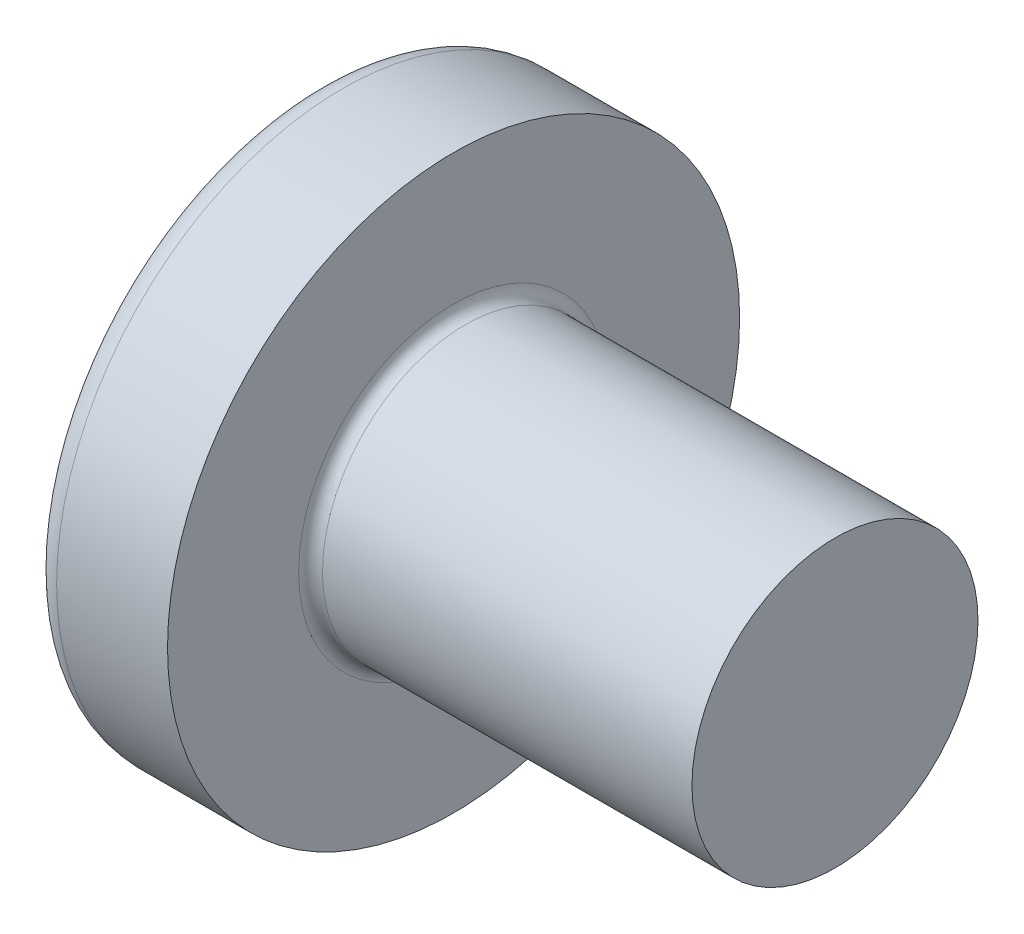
ISO-10303-21;
HEADER;
FILE_DESCRIPTION(('STEP AP214'),'2;1');
FILE_NAME('part.step','',(''),(''),'','','');
FILE_SCHEMA(('AUTOMOTIVE_DESIGN { 1 0 10303 214 1 1 1 1 }'));
ENDSEC;
DATA;
#1=APPLICATION_CONTEXT('core data for automotive mechanical design processes');
#2=APPLICATION_PROTOCOL_DEFINITION('international standard','automotive_design',2000,#1);
#3=PRODUCT_CONTEXT('',#1,'mechanical');
#4=PRODUCT('Part','Part','',(#3));
#5=PRODUCT_RELATED_PRODUCT_CATEGORY('part','',(#4));
#6=PRODUCT_DEFINITION_FORMATION('','',#4);
#7=PRODUCT_DEFINITION_CONTEXT('part definition',#1,'design');
#8=PRODUCT_DEFINITION('design','',#6,#7);
#9=PRODUCT_DEFINITION_SHAPE('','',#8);
#10=(LENGTH_UNIT() NAMED_UNIT(*) SI_UNIT(.MILLI.,.METRE.));
#11=(NAMED_UNIT(*) PLANE_ANGLE_UNIT() SI_UNIT($,.RADIAN.));
#12=(NAMED_UNIT(*) SI_UNIT($,.STERADIAN.) SOLID_ANGLE_UNIT());
#13=UNCERTAINTY_MEASURE_WITH_UNIT(LENGTH_MEASURE(1.E-05),#10,'distance_accuracy_value','');
#14=(GEOMETRIC_REPRESENTATION_CONTEXT(3) GLOBAL_UNCERTAINTY_ASSIGNED_CONTEXT((#13)) GLOBAL_UNIT_ASSIGNED_CONTEXT((#10,
#11,#12)) REPRESENTATION_CONTEXT('',''));
#15=CARTESIAN_POINT('',(0.,0.,0.));
#16=DIRECTION('',(0.,0.,1.));
#17=DIRECTION('',(1.,0.,0.));
#18=AXIS2_PLACEMENT_3D('',#15,#16,#17);
#19=CARTESIAN_POINT('',(10.,0.,0.));
#20=DIRECTION('',(-1.,0.,0.));
#21=DIRECTION('',(0.,1.,0.));
#22=AXIS2_PLACEMENT_3D('',#19,#20,#21);
#23=SPHERICAL_SURFACE('',#22,10.);
#24=CARTESIAN_POINT('',(1.83373872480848,0.,0.));
#25=DIRECTION('',(-1.,0.,0.));
#26=DIRECTION('',(0.,0.,1.));
#27=AXIS2_PLACEMENT_3D('',#24,#25,#26);
#28=CIRCLE('',#27,5.77167019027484);
#29=CARTESIAN_POINT('',(1.83373872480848,0.,5.77167019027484));
#30=VERTEX_POINT('',#29);
#31=EDGE_CURVE('E213',#30,#30,#28,.T.);
#32=ORIENTED_EDGE('',*,*,#31,.T.);
#33=EDGE_LOOP('',(#32));
#34=FACE_BOUND('',#33,.T.);
#35=CARTESIAN_POINT('',(0.11533271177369,0.,0.));
#36=DIRECTION('',(1.,0.,0.));
#37=DIRECTION('',(0.,0.,-1.));
#38=AXIS2_PLACEMENT_3D('',#35,#36,#37);
#39=CIRCLE('',#38,1.51438192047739);
#40=CARTESIAN_POINT('',(0.115332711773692,-0.709999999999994,-1.33762947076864));
#41=VERTEX_POINT('',#40);
#42=CARTESIAN_POINT('',(0.115332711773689,-1.33762947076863,-0.71));
#43=VERTEX_POINT('',#42);
#44=EDGE_CURVE('E339',#41,#43,#39,.F.);
#45=ORIENTED_EDGE('',*,*,#44,.F.);
#46=CARTESIAN_POINT('',(10.,-0.710000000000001,0.));
#47=DIRECTION('',(0.,1.,0.));
#48=DIRECTION('',(0.,0.,1.));
#49=AXIS2_PLACEMENT_3D('',#46,#47,#48);
#50=CIRCLE('',#49,9.97476315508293);
#51=CARTESIAN_POINT('',(0.5166959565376,-0.709999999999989,-3.09238490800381));
#52=VERTEX_POINT('',#51);
#53=EDGE_CURVE('E273',#52,#41,#50,.T.);
#54=ORIENTED_EDGE('',*,*,#53,.F.);
#55=CARTESIAN_POINT('',(9.34678967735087,0.,1.31013726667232));
#56=DIRECTION('',(0.446197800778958,0.,-0.894934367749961));
#57=DIRECTION('',(-0.89493436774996,0.,-0.446197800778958));
#58=AXIS2_PLACEMENT_3D('',#55,#56,#57);
#59=CIRCLE('',#58,9.89226246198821);
#60=CARTESIAN_POINT('',(0.5166959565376,0.710000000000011,-3.09238490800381));
#61=VERTEX_POINT('',#60);
#62=EDGE_CURVE('E247',#52,#61,#59,.T.);
#63=ORIENTED_EDGE('',*,*,#62,.T.);
#64=CARTESIAN_POINT('',(10.,0.71,0.));
#65=DIRECTION('',(0.,-1.,0.));
#66=DIRECTION('',(0.,0.,-1.));
#67=AXIS2_PLACEMENT_3D('',#64,#65,#66);
#68=CIRCLE('',#67,9.97476315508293);
#69=CARTESIAN_POINT('',(0.115332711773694,0.710000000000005,-1.33762947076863));
#70=VERTEX_POINT('',#69);
#71=EDGE_CURVE('E301',#70,#61,#68,.T.);
#72=ORIENTED_EDGE('',*,*,#71,.F.);
#73=CARTESIAN_POINT('',(0.115332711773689,1.33762947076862,-0.71));
#74=VERTEX_POINT('',#73);
#75=EDGE_CURVE('E354',#74,#70,#39,.F.);
#76=ORIENTED_EDGE('',*,*,#75,.F.);
#77=CARTESIAN_POINT('',(10.,0.,-0.71));
#78=DIRECTION('',(0.,0.,1.));
#79=DIRECTION('',(1.,0.,0.));
#80=AXIS2_PLACEMENT_3D('',#77,#78,#79);
#81=CIRCLE('',#80,9.97476315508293);
#82=CARTESIAN_POINT('',(0.516695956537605,3.09238490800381,-0.71));
#83=VERTEX_POINT('',#82);
#84=EDGE_CURVE('E241',#83,#74,#81,.T.);
#85=ORIENTED_EDGE('',*,*,#84,.F.);
#86=CARTESIAN_POINT('',(9.34678967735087,-1.31013726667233,0.));
#87=DIRECTION('',(0.446197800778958,0.89493436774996,0.));
#88=DIRECTION('',(-0.89493436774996,0.446197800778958,0.));
#89=AXIS2_PLACEMENT_3D('',#86,#87,#88);
#90=CIRCLE('',#89,9.89226246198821);
#91=CARTESIAN_POINT('',(0.516695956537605,3.09238490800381,0.71));
#92=VERTEX_POINT('',#91);
#93=EDGE_CURVE('E244',#83,#92,#90,.T.);
#94=ORIENTED_EDGE('',*,*,#93,.T.);
#95=CARTESIAN_POINT('',(10.,0.,0.71));
#96=DIRECTION('',(0.,0.,-1.));
#97=DIRECTION('',(-1.,0.,0.));
#98=AXIS2_PLACEMENT_3D('',#95,#96,#97);
#99=CIRCLE('',#98,9.97476315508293);
#100=CARTESIAN_POINT('',(0.115332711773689,1.33762947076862,0.709999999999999));
#101=VERTEX_POINT('',#100);
#102=EDGE_CURVE('E237',#101,#92,#99,.T.);
#103=ORIENTED_EDGE('',*,*,#102,.F.);
#104=CARTESIAN_POINT('',(0.115332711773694,0.709999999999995,1.33762947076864));
#105=VERTEX_POINT('',#104);
#106=EDGE_CURVE('E353',#105,#101,#39,.F.);
#107=ORIENTED_EDGE('',*,*,#106,.F.);
#108=CARTESIAN_POINT('',(0.516695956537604,0.709999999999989,3.09238490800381));
#109=VERTEX_POINT('',#108);
#110=EDGE_CURVE('E257',#109,#105,#68,.T.);
#111=ORIENTED_EDGE('',*,*,#110,.F.);
#112=CARTESIAN_POINT('',(9.34678967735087,0.,-1.31013726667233));
#113=DIRECTION('',(0.446197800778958,0.,0.89493436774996));
#114=DIRECTION('',(0.89493436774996,0.,-0.446197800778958));
#115=AXIS2_PLACEMENT_3D('',#112,#113,#114);
#116=CIRCLE('',#115,9.89226246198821);
#117=CARTESIAN_POINT('',(0.516695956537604,-0.710000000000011,3.09238490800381));
#118=VERTEX_POINT('',#117);
#119=EDGE_CURVE('E48',#109,#118,#116,.T.);
#120=ORIENTED_EDGE('',*,*,#119,.T.);
#121=CARTESIAN_POINT('',(0.115332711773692,-0.710000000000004,1.33762947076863));
#122=VERTEX_POINT('',#121);
#123=EDGE_CURVE('E254',#122,#118,#50,.T.);
#124=ORIENTED_EDGE('',*,*,#123,.F.);
#125=CARTESIAN_POINT('',(0.115332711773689,-1.33762947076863,0.709999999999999));
#126=VERTEX_POINT('',#125);
#127=EDGE_CURVE('E385',#126,#122,#39,.F.);
#128=ORIENTED_EDGE('',*,*,#127,.F.);
#129=CARTESIAN_POINT('',(0.5166959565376,-3.09238490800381,0.71));
#130=VERTEX_POINT('',#129);
#131=EDGE_CURVE('E238',#130,#126,#99,.T.);
#132=ORIENTED_EDGE('',*,*,#131,.F.);
#133=CARTESIAN_POINT('',(9.34678967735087,1.31013726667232,0.));
#134=DIRECTION('',(0.446197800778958,-0.894934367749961,0.));
#135=DIRECTION('',(0.89493436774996,0.446197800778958,0.));
#136=AXIS2_PLACEMENT_3D('',#133,#134,#135);
#137=CIRCLE('',#136,9.89226246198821);
#138=CARTESIAN_POINT('',(0.5166959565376,-3.09238490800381,-0.710000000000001));
#139=VERTEX_POINT('',#138);
#140=EDGE_CURVE('E234',#130,#139,#137,.T.);
#141=ORIENTED_EDGE('',*,*,#140,.T.);
#142=EDGE_CURVE('E63',#43,#139,#81,.T.);
#143=ORIENTED_EDGE('',*,*,#142,.F.);
#144=EDGE_LOOP('',(#45,#54,#63,#72,#76,#85,#94,#103,#107,#111,#120,#124,#128,#132,#141,#143));
#145=FACE_BOUND('',#144,.T.);
#146=ADVANCED_FACE('F35',(#34,#145),#23,.T.);
#147=CARTESIAN_POINT('',(3.46,1.6249076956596,-0.71));
#148=DIRECTION('',(0.,0.,1.));
#149=DIRECTION('',(1.,0.,0.));
#150=AXIS2_PLACEMENT_3D('',#147,#148,#149);
#151=PLANE('',#150);
#152=ORIENTED_EDGE('',*,*,#84,.T.);
#153=CARTESIAN_POINT('',(-2.28089704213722,1.52473965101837,-0.71));
#154=CARTESIAN_POINT('',(-1.81861622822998,1.48907386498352,-0.71));
#155=CARTESIAN_POINT('',(-1.35635131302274,1.45320000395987,-0.71));
#156=CARTESIAN_POINT('',(-0.431857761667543,1.3808964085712,-0.71));
#157=CARTESIAN_POINT('',(0.0303708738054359,1.34446666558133,-0.71));
#158=CARTESIAN_POINT('',(0.954772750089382,1.27091270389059,-0.71));
#159=CARTESIAN_POINT('',(1.41694599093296,1.23378848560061,-0.71));
#160=CARTESIAN_POINT('',(2.1101468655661,1.17741958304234,-0.71));
#161=CARTESIAN_POINT('',(2.34120225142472,1.15851633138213,-0.71));
#162=CARTESIAN_POINT('',(2.80329254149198,1.12044387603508,-0.71));
#163=CARTESIAN_POINT('',(3.03432744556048,1.10127467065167,-0.71));
#164=CARTESIAN_POINT('',(3.81376951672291,1.03608826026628,-0.71));
#165=CARTESIAN_POINT('',(4.3621185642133,0.989367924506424,-0.71));
#166=CARTESIAN_POINT('',(5.18446393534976,0.917336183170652,-0.71));
#167=CARTESIAN_POINT('',(5.45854573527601,0.893000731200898,-0.71));
#168=CARTESIAN_POINT('',(6.00663594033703,0.843493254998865,-0.71));
#169=CARTESIAN_POINT('',(6.28064434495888,0.818321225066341,-0.71));
#170=CARTESIAN_POINT('',(6.82859287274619,0.766879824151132,-0.71));
#171=CARTESIAN_POINT('',(7.10253298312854,0.74061031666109,-0.71));
#172=CARTESIAN_POINT('',(7.65026285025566,0.686585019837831,-0.71));
#173=CARTESIAN_POINT('',(7.92405260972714,0.658829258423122,-0.71));
#174=CARTESIAN_POINT('',(8.33458184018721,0.615573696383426,-0.71));
#175=CARTESIAN_POINT('',(8.4714065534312,0.600884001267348,-0.71));
#176=CARTESIAN_POINT('',(8.74498055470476,0.570826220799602,-0.71));
#177=CARTESIAN_POINT('',(8.88172984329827,0.555458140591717,-0.71));
#178=CARTESIAN_POINT('',(9.15513948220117,0.523868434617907,-0.71));
#179=CARTESIAN_POINT('',(9.29179982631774,0.507646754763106,-0.71));
#180=CARTESIAN_POINT('',(9.56498051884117,0.474039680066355,-0.71));
#181=CARTESIAN_POINT('',(9.70150086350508,0.45665425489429,-0.71));
#182=CARTESIAN_POINT('',(9.83792645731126,0.438531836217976,-0.71));
#183=B_SPLINE_CURVE_WITH_KNOTS('',3,(#153,#154,#155,#156,#157,#158,#159,#160,#161,#162,#163,
#164,#165,#166,#167,#168,#169,#170,#171,#172,#173,#174,#175,#176,#177,#178,#179,#180,#181,#182),
.UNSPECIFIED.,.F.,.F.,(4,2,2,2,2,2,2,2,2,2,2,2,2,2,4),(0.,1.39096401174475,2.78194962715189,
4.17293441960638,4.86841633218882,5.56390268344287,7.21490482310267,8.04038405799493,
8.86586891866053,9.69145676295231,10.5170291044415,10.9298607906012,11.3426893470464,
11.7555440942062,12.1684096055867),.UNSPECIFIED.);
#184=CARTESIAN_POINT('',(3.46,1.06563607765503,-0.710000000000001));
#185=VERTEX_POINT('',#184);
#186=EDGE_CURVE('E374',#74,#185,#183,.T.);
#187=ORIENTED_EDGE('',*,*,#186,.T.);
#188=DIRECTION('',(0.,1.,0.));
#189=VECTOR('',#188,1.);
#190=CARTESIAN_POINT('',(3.46,-1.6249076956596,-0.71));
#191=LINE('',#190,#189);
#192=CARTESIAN_POINT('',(3.46,1.6249076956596,-0.71));
#193=VERTEX_POINT('',#192);
#194=EDGE_CURVE('E322',#185,#193,#191,.T.);
#195=ORIENTED_EDGE('',*,*,#194,.T.);
#196=DIRECTION('',(0.89493436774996,-0.446197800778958,0.));
#197=VECTOR('',#196,1.);
#198=CARTESIAN_POINT('',(0.,3.35,-0.71));
#199=LINE('',#198,#197);
#200=EDGE_CURVE('E214',#83,#193,#199,.T.);
#201=ORIENTED_EDGE('',*,*,#200,.F.);
#202=EDGE_LOOP('',(#152,#187,#195,#201));
#203=FACE_BOUND('',#202,.T.);
#204=ADVANCED_FACE('F169',(#203),#151,.T.);
#205=CARTESIAN_POINT('',(3.46,-1.6249076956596,-0.71));
#206=VERTEX_POINT('',#205);
#207=CARTESIAN_POINT('',(3.46,-1.06563607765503,-0.710000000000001));
#208=VERTEX_POINT('',#207);
#209=EDGE_CURVE('E222',#206,#208,#191,.T.);
#210=ORIENTED_EDGE('',*,*,#209,.T.);
#211=CARTESIAN_POINT('',(-2.28089704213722,-1.52473965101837,-0.71));
#212=CARTESIAN_POINT('',(-1.81861622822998,-1.48907386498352,-0.71));
#213=CARTESIAN_POINT('',(-1.35635131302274,-1.45320000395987,-0.71));
#214=CARTESIAN_POINT('',(-0.431857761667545,-1.3808964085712,-0.71));
#215=CARTESIAN_POINT('',(0.0303708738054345,-1.34446666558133,-0.71));
#216=CARTESIAN_POINT('',(0.954772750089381,-1.27091270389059,-0.71));
#217=CARTESIAN_POINT('',(1.41694599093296,-1.23378848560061,-0.71));
#218=CARTESIAN_POINT('',(2.1101468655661,-1.17741958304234,-0.71));
#219=CARTESIAN_POINT('',(2.34120225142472,-1.15851633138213,-0.71));
#220=CARTESIAN_POINT('',(2.80329254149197,-1.12044387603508,-0.71));
#221=CARTESIAN_POINT('',(3.03432744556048,-1.10127467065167,-0.71));
#222=CARTESIAN_POINT('',(3.81376951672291,-1.03608826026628,-0.71));
#223=CARTESIAN_POINT('',(4.3621185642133,-0.989367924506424,-0.71));
#224=CARTESIAN_POINT('',(5.18446393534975,-0.917336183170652,-0.71));
#225=CARTESIAN_POINT('',(5.45854573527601,-0.893000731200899,-0.71));
#226=CARTESIAN_POINT('',(6.00663594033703,-0.843493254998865,-0.71));
#227=CARTESIAN_POINT('',(6.28064434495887,-0.818321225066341,-0.71));
#228=CARTESIAN_POINT('',(6.82859287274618,-0.766879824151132,-0.71));
#229=CARTESIAN_POINT('',(7.10253298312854,-0.740610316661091,-0.71));
#230=CARTESIAN_POINT('',(7.65026285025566,-0.686585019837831,-0.71));
#231=CARTESIAN_POINT('',(7.92405260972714,-0.658829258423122,-0.71));
#232=CARTESIAN_POINT('',(8.33458184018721,-0.615573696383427,-0.71));
#233=CARTESIAN_POINT('',(8.4714065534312,-0.600884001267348,-0.71));
#234=CARTESIAN_POINT('',(8.74498055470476,-0.570826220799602,-0.71));
#235=CARTESIAN_POINT('',(8.88172984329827,-0.555458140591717,-0.71));
#236=CARTESIAN_POINT('',(9.15513948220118,-0.523868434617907,-0.71));
#237=CARTESIAN_POINT('',(9.29179982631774,-0.507646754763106,-0.71));
#238=CARTESIAN_POINT('',(9.56498051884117,-0.474039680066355,-0.71));
#239=CARTESIAN_POINT('',(9.70150086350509,-0.456654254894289,-0.71));
#240=CARTESIAN_POINT('',(9.83792645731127,-0.438531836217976,-0.71));
#241=B_SPLINE_CURVE_WITH_KNOTS('',3,(#211,#212,#213,#214,#215,#216,#217,#218,#219,#220,#221,
#222,#223,#224,#225,#226,#227,#228,#229,#230,#231,#232,#233,#234,#235,#236,#237,#238,#239,#240),
.UNSPECIFIED.,.F.,.F.,(4,2,2,2,2,2,2,2,2,2,2,2,2,2,4),(0.,1.39096401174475,2.78194962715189,
4.17293441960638,4.86841633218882,5.56390268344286,7.21490482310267,8.04038405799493,
8.86586891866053,9.69145676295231,10.5170291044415,10.9298607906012,11.3426893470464,
11.7555440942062,12.1684096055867),.UNSPECIFIED.);
#242=EDGE_CURVE('E352',#208,#43,#241,.F.);
#243=ORIENTED_EDGE('',*,*,#242,.T.);
#244=ORIENTED_EDGE('',*,*,#142,.T.);
#245=DIRECTION('',(0.89493436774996,0.446197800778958,0.));
#246=VECTOR('',#245,1.);
#247=CARTESIAN_POINT('',(0.,-3.35,-0.71));
#248=LINE('',#247,#246);
#249=EDGE_CURVE('E304',#139,#206,#248,.T.);
#250=ORIENTED_EDGE('',*,*,#249,.T.);
#251=EDGE_LOOP('',(#210,#243,#244,#250));
#252=FACE_BOUND('',#251,.T.);
#253=ADVANCED_FACE('F175',(#252),#151,.T.);
#254=CARTESIAN_POINT('',(3.46,-1.6249076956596,0.71));
#255=DIRECTION('',(0.,0.,-1.));
#256=DIRECTION('',(-1.,0.,0.));
#257=AXIS2_PLACEMENT_3D('',#254,#255,#256);
#258=PLANE('',#257);
#259=DIRECTION('',(0.,-1.,0.));
#260=VECTOR('',#259,1.);
#261=CARTESIAN_POINT('',(3.46,1.6249076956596,0.71));
#262=LINE('',#261,#260);
#263=CARTESIAN_POINT('',(3.46,1.6249076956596,0.71));
#264=VERTEX_POINT('',#263);
#265=CARTESIAN_POINT('',(3.46,1.06563607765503,0.710000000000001));
#266=VERTEX_POINT('',#265);
#267=EDGE_CURVE('E312',#264,#266,#262,.T.);
#268=ORIENTED_EDGE('',*,*,#267,.T.);
#269=CARTESIAN_POINT('',(-2.28089705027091,1.52473965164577,0.709999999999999));
#270=CARTESIAN_POINT('',(-1.81861623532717,1.48907386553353,0.709999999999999));
#271=CARTESIAN_POINT('',(-1.35635131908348,1.45320000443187,0.709999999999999));
#272=CARTESIAN_POINT('',(-0.431857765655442,1.38089640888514,0.709999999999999));
#273=CARTESIAN_POINT('',(0.0303708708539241,1.3444666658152,0.709999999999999));
#274=CARTESIAN_POINT('',(0.954772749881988,1.27091270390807,0.71));
#275=CARTESIAN_POINT('',(1.41694599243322,1.23378848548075,0.71));
#276=CARTESIAN_POINT('',(2.11014686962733,1.17741958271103,0.71));
#277=CARTESIAN_POINT('',(2.3412022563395,1.15851633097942,0.71));
#278=CARTESIAN_POINT('',(2.80329254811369,1.12044387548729,0.71));
#279=CARTESIAN_POINT('',(3.03432745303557,1.10127467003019,0.71));
#280=CARTESIAN_POINT('',(3.8137695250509,1.03608825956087,0.71));
#281=CARTESIAN_POINT('',(4.36211857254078,0.989367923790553,0.71));
#282=CARTESIAN_POINT('',(5.18446394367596,0.917336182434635,0.71));
#283=CARTESIAN_POINT('',(5.45854574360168,0.893000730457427,0.71));
#284=CARTESIAN_POINT('',(6.00663594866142,0.843493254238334,0.71));
#285=CARTESIAN_POINT('',(6.28064435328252,0.818321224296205,0.71));
#286=CARTESIAN_POINT('',(6.82859288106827,0.766879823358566,0.71));
#287=CARTESIAN_POINT('',(7.1025329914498,0.740610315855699,0.71));
#288=CARTESIAN_POINT('',(7.65026285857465,0.686585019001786,0.71));
#289=CARTESIAN_POINT('',(7.92405261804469,0.658829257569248,0.71));
#290=CARTESIAN_POINT('',(8.3345818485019,0.61557369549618,0.71));
#291=CARTESIAN_POINT('',(8.47140656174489,0.600884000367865,0.71));
#292=CARTESIAN_POINT('',(8.74498056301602,0.570826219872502,0.71));
#293=CARTESIAN_POINT('',(8.8817298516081,0.555458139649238,0.71));
#294=CARTESIAN_POINT('',(9.15513949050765,0.523868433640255,0.71));
#295=CARTESIAN_POINT('',(9.29179983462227,0.507646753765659,0.710000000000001));
#296=CARTESIAN_POINT('',(9.56498052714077,0.474039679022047,0.710000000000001));
#297=CARTESIAN_POINT('',(9.70150087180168,0.456654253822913,0.710000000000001));
#298=CARTESIAN_POINT('',(9.83792646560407,0.438531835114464,0.710000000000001));
#299=B_SPLINE_CURVE_WITH_KNOTS('',3,(#269,#270,#271,#272,#273,#274,#275,#276,#277,#278,#279,
#280,#281,#282,#283,#284,#285,#286,#287,#288,#289,#290,#291,#292,#293,#294,#295,#296,#297,#298),
.UNSPECIFIED.,.F.,.F.,(4,2,2,2,2,2,2,2,2,2,2,2,2,2,4),(0.,1.39096401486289,2.78194963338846,
4.17293443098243,4.86841634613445,5.56390269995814,7.21490483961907,8.04038407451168,
8.8658689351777,9.69145677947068,10.5170291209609,10.9298608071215,11.3426893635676,
11.7555441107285,12.1684096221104),.UNSPECIFIED.);
#300=EDGE_CURVE('E278',#266,#101,#299,.F.);
#301=ORIENTED_EDGE('',*,*,#300,.T.);
#302=ORIENTED_EDGE('',*,*,#102,.T.);
#303=DIRECTION('',(0.89493436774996,-0.446197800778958,0.));
#304=VECTOR('',#303,1.);
#305=CARTESIAN_POINT('',(0.,3.35,0.71));
#306=LINE('',#305,#304);
#307=EDGE_CURVE('E219',#92,#264,#306,.T.);
#308=ORIENTED_EDGE('',*,*,#307,.T.);
#309=EDGE_LOOP('',(#268,#301,#302,#308));
#310=FACE_BOUND('',#309,.T.);
#311=ADVANCED_FACE('F370',(#310),#258,.T.);
#312=ORIENTED_EDGE('',*,*,#131,.T.);
#313=CARTESIAN_POINT('',(-2.28089705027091,-1.52473965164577,0.709999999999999));
#314=CARTESIAN_POINT('',(-1.81861623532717,-1.48907386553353,0.709999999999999));
#315=CARTESIAN_POINT('',(-1.35635131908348,-1.45320000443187,0.709999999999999));
#316=CARTESIAN_POINT('',(-0.431857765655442,-1.38089640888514,0.709999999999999));
#317=CARTESIAN_POINT('',(0.0303708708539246,-1.3444666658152,0.709999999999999));
#318=CARTESIAN_POINT('',(0.954772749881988,-1.27091270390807,0.709999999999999));
#319=CARTESIAN_POINT('',(1.41694599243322,-1.23378848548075,0.709999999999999));
#320=CARTESIAN_POINT('',(2.11014686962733,-1.17741958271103,0.709999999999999));
#321=CARTESIAN_POINT('',(2.3412022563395,-1.15851633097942,0.709999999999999));
#322=CARTESIAN_POINT('',(2.80329254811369,-1.12044387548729,0.709999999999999));
#323=CARTESIAN_POINT('',(3.03432745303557,-1.10127467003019,0.71));
#324=CARTESIAN_POINT('',(3.8137695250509,-1.03608825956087,0.71));
#325=CARTESIAN_POINT('',(4.36211857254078,-0.989367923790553,0.71));
#326=CARTESIAN_POINT('',(5.18446394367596,-0.917336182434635,0.71));
#327=CARTESIAN_POINT('',(5.45854574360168,-0.893000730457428,0.71));
#328=CARTESIAN_POINT('',(6.00663594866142,-0.843493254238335,0.71));
#329=CARTESIAN_POINT('',(6.28064435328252,-0.818321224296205,0.71));
#330=CARTESIAN_POINT('',(6.82859288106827,-0.766879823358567,0.71));
#331=CARTESIAN_POINT('',(7.1025329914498,-0.7406103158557,0.71));
#332=CARTESIAN_POINT('',(7.65026285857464,-0.686585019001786,0.71));
#333=CARTESIAN_POINT('',(7.92405261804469,-0.658829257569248,0.71));
#334=CARTESIAN_POINT('',(8.3345818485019,-0.615573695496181,0.71));
#335=CARTESIAN_POINT('',(8.47140656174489,-0.600884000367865,0.71));
#336=CARTESIAN_POINT('',(8.74498056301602,-0.570826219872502,0.71));
#337=CARTESIAN_POINT('',(8.8817298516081,-0.555458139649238,0.71));
#338=CARTESIAN_POINT('',(9.15513949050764,-0.523868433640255,0.71));
#339=CARTESIAN_POINT('',(9.29179983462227,-0.50764675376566,0.71));
#340=CARTESIAN_POINT('',(9.56498052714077,-0.474039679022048,0.71));
#341=CARTESIAN_POINT('',(9.70150087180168,-0.456654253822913,0.710000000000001));
#342=CARTESIAN_POINT('',(9.83792646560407,-0.438531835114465,0.71));
#343=B_SPLINE_CURVE_WITH_KNOTS('',3,(#313,#314,#315,#316,#317,#318,#319,#320,#321,#322,#323,
#324,#325,#326,#327,#328,#329,#330,#331,#332,#333,#334,#335,#336,#337,#338,#339,#340,#341,#342),
.UNSPECIFIED.,.F.,.F.,(4,2,2,2,2,2,2,2,2,2,2,2,2,2,4),(0.,1.39096401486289,2.78194963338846,
4.17293443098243,4.86841634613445,5.56390269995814,7.21490483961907,8.04038407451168,
8.8658689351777,9.69145677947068,10.5170291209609,10.9298608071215,11.3426893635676,
11.7555441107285,12.1684096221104),.UNSPECIFIED.);
#344=CARTESIAN_POINT('',(3.46,-1.06563607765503,0.71));
#345=VERTEX_POINT('',#344);
#346=EDGE_CURVE('E386',#126,#345,#343,.T.);
#347=ORIENTED_EDGE('',*,*,#346,.T.);
#348=CARTESIAN_POINT('',(3.46,-1.6249076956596,0.71));
#349=VERTEX_POINT('',#348);
#350=EDGE_CURVE('E314',#345,#349,#262,.T.);
#351=ORIENTED_EDGE('',*,*,#350,.T.);
#352=DIRECTION('',(0.89493436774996,0.446197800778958,0.));
#353=VECTOR('',#352,1.);
#354=CARTESIAN_POINT('',(0.,-3.35,0.709999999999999));
#355=LINE('',#354,#353);
#356=EDGE_CURVE('E306',#130,#349,#355,.T.);
#357=ORIENTED_EDGE('',*,*,#356,.F.);
#358=EDGE_LOOP('',(#312,#347,#351,#357));
#359=FACE_BOUND('',#358,.T.);
#360=ADVANCED_FACE('F413',(#359),#258,.T.);
#361=CARTESIAN_POINT('',(3.46,1.6249076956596,-0.71));
#362=DIRECTION('',(-1.,0.,0.));
#363=DIRECTION('',(0.,0.,1.));
#364=AXIS2_PLACEMENT_3D('',#361,#362,#363);
#365=PLANE('',#364);
#366=ORIENTED_EDGE('',*,*,#350,.F.);
#367=CARTESIAN_POINT('',(3.46,0.,0.));
#368=DIRECTION('',(-1.,0.,0.));
#369=DIRECTION('',(0.,0.,1.));
#370=AXIS2_PLACEMENT_3D('',#367,#368,#369);
#371=CIRCLE('',#370,1.2805);
#372=EDGE_CURVE('E347',#208,#345,#371,.T.);
#373=ORIENTED_EDGE('',*,*,#372,.F.);
#374=ORIENTED_EDGE('',*,*,#209,.F.);
#375=DIRECTION('',(0.,0.,1.));
#376=VECTOR('',#375,1.);
#377=CARTESIAN_POINT('',(3.46,-1.6249076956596,-0.71));
#378=LINE('',#377,#376);
#379=EDGE_CURVE('E309',#206,#349,#378,.T.);
#380=ORIENTED_EDGE('',*,*,#379,.T.);
#381=EDGE_LOOP('',(#366,#373,#374,#380));
#382=FACE_BOUND('',#381,.T.);
#383=ADVANCED_FACE('F411',(#382),#365,.T.);
#384=DIRECTION('',(0.,0.,-1.));
#385=VECTOR('',#384,1.);
#386=CARTESIAN_POINT('',(3.46,-0.710000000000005,1.6249076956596));
#387=LINE('',#386,#385);
#388=CARTESIAN_POINT('',(3.46,-0.709999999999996,-1.06563607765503));
#389=VERTEX_POINT('',#388);
#390=CARTESIAN_POINT('',(3.46,-0.709999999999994,-1.62490769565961));
#391=VERTEX_POINT('',#390);
#392=EDGE_CURVE('E295',#389,#391,#387,.T.);
#393=ORIENTED_EDGE('',*,*,#392,.F.);
#394=CARTESIAN_POINT('',(3.46,0.710000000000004,-1.06563607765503));
#395=VERTEX_POINT('',#394);
#396=EDGE_CURVE('E55',#395,#389,#371,.T.);
#397=ORIENTED_EDGE('',*,*,#396,.F.);
#398=DIRECTION('',(0.,0.,1.));
#399=VECTOR('',#398,1.);
#400=CARTESIAN_POINT('',(3.46,0.710000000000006,-1.6249076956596));
#401=LINE('',#400,#399);
#402=CARTESIAN_POINT('',(3.46,0.710000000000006,-1.6249076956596));
#403=VERTEX_POINT('',#402);
#404=EDGE_CURVE('E298',#403,#395,#401,.T.);
#405=ORIENTED_EDGE('',*,*,#404,.F.);
#406=DIRECTION('',(0.,-1.,0.));
#407=VECTOR('',#406,1.);
#408=CARTESIAN_POINT('',(3.46,0.710000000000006,-1.6249076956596));
#409=LINE('',#408,#407);
#410=EDGE_CURVE('E289',#403,#391,#409,.T.);
#411=ORIENTED_EDGE('',*,*,#410,.T.);
#412=EDGE_LOOP('',(#393,#397,#405,#411));
#413=FACE_BOUND('',#412,.T.);
#414=ADVANCED_FACE('F342',(#413),#365,.T.);
#415=ORIENTED_EDGE('',*,*,#194,.F.);
#416=EDGE_CURVE('E346',#266,#185,#371,.T.);
#417=ORIENTED_EDGE('',*,*,#416,.F.);
#418=ORIENTED_EDGE('',*,*,#267,.F.);
#419=DIRECTION('',(0.,0.,-1.));
#420=VECTOR('',#419,1.);
#421=CARTESIAN_POINT('',(3.46,1.6249076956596,0.71));
#422=LINE('',#421,#420);
#423=EDGE_CURVE('E315',#264,#193,#422,.T.);
#424=ORIENTED_EDGE('',*,*,#423,.T.);
#425=EDGE_LOOP('',(#415,#417,#418,#424));
#426=FACE_BOUND('',#425,.T.);
#427=ADVANCED_FACE('F420',(#426),#365,.T.);
#428=CARTESIAN_POINT('',(3.46,0.709999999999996,1.06563607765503));
#429=VERTEX_POINT('',#428);
#430=CARTESIAN_POINT('',(3.46,0.709999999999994,1.62490769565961));
#431=VERTEX_POINT('',#430);
#432=EDGE_CURVE('E271',#429,#431,#401,.T.);
#433=ORIENTED_EDGE('',*,*,#432,.F.);
#434=CARTESIAN_POINT('',(3.46,-0.710000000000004,1.06563607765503));
#435=VERTEX_POINT('',#434);
#436=EDGE_CURVE('E350',#435,#429,#371,.T.);
#437=ORIENTED_EDGE('',*,*,#436,.F.);
#438=CARTESIAN_POINT('',(3.46,-0.710000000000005,1.6249076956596));
#439=VERTEX_POINT('',#438);
#440=EDGE_CURVE('E292',#439,#435,#387,.T.);
#441=ORIENTED_EDGE('',*,*,#440,.F.);
#442=DIRECTION('',(0.,1.,0.));
#443=VECTOR('',#442,1.);
#444=CARTESIAN_POINT('',(3.46,-0.710000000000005,1.6249076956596));
#445=LINE('',#444,#443);
#446=EDGE_CURVE('E296',#439,#431,#445,.T.);
#447=ORIENTED_EDGE('',*,*,#446,.T.);
#448=EDGE_LOOP('',(#433,#437,#441,#447));
#449=FACE_BOUND('',#448,.T.);
#450=ADVANCED_FACE('F415',(#449),#365,.T.);
#451=CARTESIAN_POINT('',(3.46,0.709999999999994,1.62490769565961));
#452=DIRECTION('',(0.,-1.,0.));
#453=DIRECTION('',(1.,0.,0.));
#454=AXIS2_PLACEMENT_3D('',#451,#452,#453);
#455=PLANE('',#454);
#456=ORIENTED_EDGE('',*,*,#110,.T.);
#457=CARTESIAN_POINT('',(-2.28089704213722,0.709999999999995,1.52473965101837));
#458=CARTESIAN_POINT('',(-1.81861622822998,0.709999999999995,1.48907386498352));
#459=CARTESIAN_POINT('',(-1.35635131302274,0.709999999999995,1.45320000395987));
#460=CARTESIAN_POINT('',(-0.431857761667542,0.709999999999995,1.38089640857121));
#461=CARTESIAN_POINT('',(0.0303708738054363,0.709999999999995,1.34446666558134));
#462=CARTESIAN_POINT('',(0.954772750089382,0.709999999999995,1.2709127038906));
#463=CARTESIAN_POINT('',(1.41694599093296,0.709999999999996,1.23378848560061));
#464=CARTESIAN_POINT('',(2.1101468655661,0.709999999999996,1.17741958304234));
#465=CARTESIAN_POINT('',(2.34120225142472,0.709999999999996,1.15851633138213));
#466=CARTESIAN_POINT('',(2.80329254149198,0.709999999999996,1.12044387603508));
#467=CARTESIAN_POINT('',(3.03432744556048,0.709999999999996,1.10127467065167));
#468=CARTESIAN_POINT('',(3.81376951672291,0.709999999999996,1.03608826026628));
#469=CARTESIAN_POINT('',(4.3621185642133,0.709999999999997,0.989367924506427));
#470=CARTESIAN_POINT('',(5.18446393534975,0.709999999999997,0.917336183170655));
#471=CARTESIAN_POINT('',(5.45854573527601,0.709999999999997,0.893000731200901));
#472=CARTESIAN_POINT('',(6.00663594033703,0.709999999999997,0.843493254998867));
#473=CARTESIAN_POINT('',(6.28064434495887,0.709999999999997,0.818321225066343));
#474=CARTESIAN_POINT('',(6.82859287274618,0.709999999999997,0.766879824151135));
#475=CARTESIAN_POINT('',(7.10253298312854,0.709999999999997,0.740610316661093));
#476=CARTESIAN_POINT('',(7.65026285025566,0.709999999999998,0.686585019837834));
#477=CARTESIAN_POINT('',(7.92405260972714,0.709999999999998,0.658829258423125));
#478=CARTESIAN_POINT('',(8.33458184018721,0.709999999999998,0.615573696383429));
#479=CARTESIAN_POINT('',(8.4714065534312,0.709999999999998,0.60088400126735));
#480=CARTESIAN_POINT('',(8.74498055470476,0.709999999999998,0.570826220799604));
#481=CARTESIAN_POINT('',(8.88172984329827,0.709999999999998,0.55545814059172));
#482=CARTESIAN_POINT('',(9.15513948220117,0.709999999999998,0.52386843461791));
#483=CARTESIAN_POINT('',(9.29179982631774,0.709999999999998,0.507646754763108));
#484=CARTESIAN_POINT('',(9.56498051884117,0.709999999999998,0.474039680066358));
#485=CARTESIAN_POINT('',(9.70150086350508,0.709999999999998,0.456654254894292));
#486=CARTESIAN_POINT('',(9.83792645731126,0.709999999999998,0.438531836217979));
#487=B_SPLINE_CURVE_WITH_KNOTS('',3,(#457,#458,#459,#460,#461,#462,#463,#464,#465,#466,#467,
#468,#469,#470,#471,#472,#473,#474,#475,#476,#477,#478,#479,#480,#481,#482,#483,#484,#485,#486),
.UNSPECIFIED.,.F.,.F.,(4,2,2,2,2,2,2,2,2,2,2,2,2,2,4),(0.,1.39096401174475,2.78194962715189,
4.17293441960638,4.86841633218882,5.56390268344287,7.21490482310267,8.04038405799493,
8.86586891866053,9.69145676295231,10.5170291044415,10.9298607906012,11.3426893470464,
11.7555440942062,12.1684096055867),.UNSPECIFIED.);
#488=EDGE_CURVE('E434',#105,#429,#487,.T.);
#489=ORIENTED_EDGE('',*,*,#488,.T.);
#490=ORIENTED_EDGE('',*,*,#432,.T.);
#491=DIRECTION('',(0.89493436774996,0.,-0.446197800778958));
#492=VECTOR('',#491,1.);
#493=CARTESIAN_POINT('',(0.,0.709999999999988,3.35));
#494=LINE('',#493,#492);
#495=EDGE_CURVE('E264',#109,#431,#494,.T.);
#496=ORIENTED_EDGE('',*,*,#495,.F.);
#497=EDGE_LOOP('',(#456,#489,#490,#496));
#498=FACE_BOUND('',#497,.T.);
#499=ADVANCED_FACE('F268',(#498),#455,.T.);
#500=CARTESIAN_POINT('',(3.46,-0.709999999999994,-1.62490769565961));
#501=DIRECTION('',(0.,1.,0.));
#502=DIRECTION('',(-1.,0.,0.));
#503=AXIS2_PLACEMENT_3D('',#500,#501,#502);
#504=PLANE('',#503);
#505=ORIENTED_EDGE('',*,*,#440,.T.);
#506=CARTESIAN_POINT('',(-2.28089704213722,-0.710000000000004,1.52473965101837));
#507=CARTESIAN_POINT('',(-1.81861622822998,-0.710000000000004,1.48907386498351));
#508=CARTESIAN_POINT('',(-1.35635131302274,-0.710000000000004,1.45320000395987));
#509=CARTESIAN_POINT('',(-0.431857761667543,-0.710000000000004,1.3808964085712));
#510=CARTESIAN_POINT('',(0.0303708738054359,-0.710000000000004,1.34446666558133));
#511=CARTESIAN_POINT('',(0.954772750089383,-0.710000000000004,1.27091270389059));
#512=CARTESIAN_POINT('',(1.41694599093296,-0.710000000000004,1.23378848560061));
#513=CARTESIAN_POINT('',(2.1101468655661,-0.710000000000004,1.17741958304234));
#514=CARTESIAN_POINT('',(2.34120225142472,-0.710000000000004,1.15851633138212));
#515=CARTESIAN_POINT('',(2.80329254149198,-0.710000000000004,1.12044387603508));
#516=CARTESIAN_POINT('',(3.03432744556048,-0.710000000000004,1.10127467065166));
#517=CARTESIAN_POINT('',(3.81376951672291,-0.710000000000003,1.03608826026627));
#518=CARTESIAN_POINT('',(4.3621185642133,-0.710000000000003,0.989367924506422));
#519=CARTESIAN_POINT('',(5.18446393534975,-0.710000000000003,0.91733618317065));
#520=CARTESIAN_POINT('',(5.45854573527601,-0.710000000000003,0.893000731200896));
#521=CARTESIAN_POINT('',(6.00663594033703,-0.710000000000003,0.843493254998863));
#522=CARTESIAN_POINT('',(6.28064434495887,-0.710000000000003,0.818321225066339));
#523=CARTESIAN_POINT('',(6.82859287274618,-0.710000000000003,0.76687982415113));
#524=CARTESIAN_POINT('',(7.10253298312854,-0.710000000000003,0.740610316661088));
#525=CARTESIAN_POINT('',(7.65026285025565,-0.710000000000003,0.686585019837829));
#526=CARTESIAN_POINT('',(7.92405260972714,-0.710000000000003,0.65882925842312));
#527=CARTESIAN_POINT('',(8.33458184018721,-0.710000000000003,0.615573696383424));
#528=CARTESIAN_POINT('',(8.4714065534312,-0.710000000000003,0.600884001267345));
#529=CARTESIAN_POINT('',(8.74498055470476,-0.710000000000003,0.570826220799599));
#530=CARTESIAN_POINT('',(8.88172984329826,-0.710000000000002,0.555458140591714));
#531=CARTESIAN_POINT('',(9.15513948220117,-0.710000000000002,0.523868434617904));
#532=CARTESIAN_POINT('',(9.29179982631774,-0.710000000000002,0.507646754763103));
#533=CARTESIAN_POINT('',(9.56498051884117,-0.710000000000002,0.474039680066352));
#534=CARTESIAN_POINT('',(9.70150086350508,-0.710000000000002,0.456654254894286));
#535=CARTESIAN_POINT('',(9.83792645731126,-0.710000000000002,0.438531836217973));
#536=B_SPLINE_CURVE_WITH_KNOTS('',3,(#506,#507,#508,#509,#510,#511,#512,#513,#514,#515,#516,
#517,#518,#519,#520,#521,#522,#523,#524,#525,#526,#527,#528,#529,#530,#531,#532,#533,#534,#535),
.UNSPECIFIED.,.F.,.F.,(4,2,2,2,2,2,2,2,2,2,2,2,2,2,4),(0.,1.39096401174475,2.78194962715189,
4.17293441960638,4.86841633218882,5.56390268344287,7.21490482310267,8.04038405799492,
8.86586891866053,9.69145676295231,10.5170291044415,10.9298607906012,11.3426893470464,
11.7555440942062,12.1684096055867),.UNSPECIFIED.);
#537=EDGE_CURVE('E379',#435,#122,#536,.F.);
#538=ORIENTED_EDGE('',*,*,#537,.T.);
#539=ORIENTED_EDGE('',*,*,#123,.T.);
#540=DIRECTION('',(0.89493436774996,0.,-0.446197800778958));
#541=VECTOR('',#540,1.);
#542=CARTESIAN_POINT('',(0.,-0.710000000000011,3.35));
#543=LINE('',#542,#541);
#544=EDGE_CURVE('E266',#118,#439,#543,.T.);
#545=ORIENTED_EDGE('',*,*,#544,.T.);
#546=EDGE_LOOP('',(#505,#538,#539,#545));
#547=FACE_BOUND('',#546,.T.);
#548=ADVANCED_FACE('F204',(#547),#504,.T.);
#549=ORIENTED_EDGE('',*,*,#404,.T.);
#550=CARTESIAN_POINT('',(-2.28089704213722,0.710000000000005,-1.52473965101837));
#551=CARTESIAN_POINT('',(-1.81861622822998,0.710000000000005,-1.48907386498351));
#552=CARTESIAN_POINT('',(-1.35635131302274,0.710000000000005,-1.45320000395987));
#553=CARTESIAN_POINT('',(-0.431857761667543,0.710000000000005,-1.3808964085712));
#554=CARTESIAN_POINT('',(0.0303708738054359,0.710000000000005,-1.34446666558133));
#555=CARTESIAN_POINT('',(0.954772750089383,0.710000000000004,-1.27091270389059));
#556=CARTESIAN_POINT('',(1.41694599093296,0.710000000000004,-1.23378848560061));
#557=CARTESIAN_POINT('',(2.1101468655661,0.710000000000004,-1.17741958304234));
#558=CARTESIAN_POINT('',(2.34120225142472,0.710000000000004,-1.15851633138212));
#559=CARTESIAN_POINT('',(2.80329254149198,0.710000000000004,-1.12044387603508));
#560=CARTESIAN_POINT('',(3.03432744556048,0.710000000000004,-1.10127467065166));
#561=CARTESIAN_POINT('',(3.81376951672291,0.710000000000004,-1.03608826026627));
#562=CARTESIAN_POINT('',(4.3621185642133,0.710000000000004,-0.989367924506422));
#563=CARTESIAN_POINT('',(5.18446393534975,0.710000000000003,-0.91733618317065));
#564=CARTESIAN_POINT('',(5.45854573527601,0.710000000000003,-0.893000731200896));
#565=CARTESIAN_POINT('',(6.00663594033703,0.710000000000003,-0.843493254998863));
#566=CARTESIAN_POINT('',(6.28064434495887,0.710000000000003,-0.818321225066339));
#567=CARTESIAN_POINT('',(6.82859287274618,0.710000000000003,-0.76687982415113));
#568=CARTESIAN_POINT('',(7.10253298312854,0.710000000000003,-0.740610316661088));
#569=CARTESIAN_POINT('',(7.65026285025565,0.710000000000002,-0.686585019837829));
#570=CARTESIAN_POINT('',(7.92405260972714,0.710000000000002,-0.65882925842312));
#571=CARTESIAN_POINT('',(8.33458184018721,0.710000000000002,-0.615573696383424));
#572=CARTESIAN_POINT('',(8.4714065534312,0.710000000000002,-0.600884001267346));
#573=CARTESIAN_POINT('',(8.74498055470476,0.710000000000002,-0.5708262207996));
#574=CARTESIAN_POINT('',(8.88172984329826,0.710000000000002,-0.555458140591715));
#575=CARTESIAN_POINT('',(9.15513948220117,0.710000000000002,-0.523868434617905));
#576=CARTESIAN_POINT('',(9.29179982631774,0.710000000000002,-0.507646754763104));
#577=CARTESIAN_POINT('',(9.56498051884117,0.710000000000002,-0.474039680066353));
#578=CARTESIAN_POINT('',(9.70150086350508,0.710000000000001,-0.456654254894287));
#579=CARTESIAN_POINT('',(9.83792645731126,0.710000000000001,-0.438531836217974));
#580=B_SPLINE_CURVE_WITH_KNOTS('',3,(#550,#551,#552,#553,#554,#555,#556,#557,#558,#559,#560,
#561,#562,#563,#564,#565,#566,#567,#568,#569,#570,#571,#572,#573,#574,#575,#576,#577,#578,#579),
.UNSPECIFIED.,.F.,.F.,(4,2,2,2,2,2,2,2,2,2,2,2,2,2,4),(0.,1.39096401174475,2.78194962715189,
4.17293441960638,4.86841633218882,5.56390268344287,7.21490482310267,8.04038405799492,
8.86586891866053,9.69145676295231,10.5170291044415,10.9298607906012,11.3426893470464,
11.7555440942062,12.1684096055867),.UNSPECIFIED.);
#581=EDGE_CURVE('E331',#395,#70,#580,.F.);
#582=ORIENTED_EDGE('',*,*,#581,.T.);
#583=ORIENTED_EDGE('',*,*,#71,.T.);
#584=DIRECTION('',(0.89493436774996,0.,0.446197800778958));
#585=VECTOR('',#584,1.);
#586=CARTESIAN_POINT('',(0.,0.710000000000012,-3.35));
#587=LINE('',#586,#585);
#588=EDGE_CURVE('E275',#61,#403,#587,.T.);
#589=ORIENTED_EDGE('',*,*,#588,.T.);
#590=EDGE_LOOP('',(#549,#582,#583,#589));
#591=FACE_BOUND('',#590,.T.);
#592=ADVANCED_FACE('F202',(#591),#455,.T.);
#593=ORIENTED_EDGE('',*,*,#53,.T.);
#594=CARTESIAN_POINT('',(-2.28089705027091,-0.709999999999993,-1.52473965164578));
#595=CARTESIAN_POINT('',(-1.81861623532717,-0.709999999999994,-1.48907386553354));
#596=CARTESIAN_POINT('',(-1.35635131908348,-0.709999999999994,-1.45320000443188));
#597=CARTESIAN_POINT('',(-0.431857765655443,-0.709999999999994,-1.38089640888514));
#598=CARTESIAN_POINT('',(0.0303708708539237,-0.709999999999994,-1.34446666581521));
#599=CARTESIAN_POINT('',(0.954772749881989,-0.709999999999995,-1.27091270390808));
#600=CARTESIAN_POINT('',(1.41694599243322,-0.709999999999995,-1.23378848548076));
#601=CARTESIAN_POINT('',(2.11014686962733,-0.709999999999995,-1.17741958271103));
#602=CARTESIAN_POINT('',(2.3412022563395,-0.709999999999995,-1.15851633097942));
#603=CARTESIAN_POINT('',(2.80329254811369,-0.709999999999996,-1.12044387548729));
#604=CARTESIAN_POINT('',(3.03432745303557,-0.709999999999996,-1.1012746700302));
#605=CARTESIAN_POINT('',(3.81376952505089,-0.709999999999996,-1.03608825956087));
#606=CARTESIAN_POINT('',(4.36211857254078,-0.709999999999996,-0.989367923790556));
#607=CARTESIAN_POINT('',(5.18446394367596,-0.709999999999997,-0.917336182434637));
#608=CARTESIAN_POINT('',(5.45854574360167,-0.709999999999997,-0.89300073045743));
#609=CARTESIAN_POINT('',(6.00663594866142,-0.709999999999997,-0.843493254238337));
#610=CARTESIAN_POINT('',(6.28064435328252,-0.709999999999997,-0.818321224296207));
#611=CARTESIAN_POINT('',(6.82859288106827,-0.709999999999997,-0.766879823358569));
#612=CARTESIAN_POINT('',(7.1025329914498,-0.709999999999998,-0.740610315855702));
#613=CARTESIAN_POINT('',(7.65026285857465,-0.709999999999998,-0.686585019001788));
#614=CARTESIAN_POINT('',(7.92405261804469,-0.709999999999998,-0.658829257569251));
#615=CARTESIAN_POINT('',(8.3345818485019,-0.709999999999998,-0.615573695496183));
#616=CARTESIAN_POINT('',(8.47140656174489,-0.709999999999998,-0.600884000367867));
#617=CARTESIAN_POINT('',(8.74498056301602,-0.709999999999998,-0.570826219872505));
#618=CARTESIAN_POINT('',(8.8817298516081,-0.709999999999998,-0.55545813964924));
#619=CARTESIAN_POINT('',(9.15513949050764,-0.709999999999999,-0.523868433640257));
#620=CARTESIAN_POINT('',(9.29179983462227,-0.709999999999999,-0.507646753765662));
#621=CARTESIAN_POINT('',(9.56498052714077,-0.709999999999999,-0.47403967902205));
#622=CARTESIAN_POINT('',(9.70150087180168,-0.709999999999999,-0.456654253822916));
#623=CARTESIAN_POINT('',(9.83792646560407,-0.709999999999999,-0.438531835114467));
#624=B_SPLINE_CURVE_WITH_KNOTS('',3,(#594,#595,#596,#597,#598,#599,#600,#601,#602,#603,#604,
#605,#606,#607,#608,#609,#610,#611,#612,#613,#614,#615,#616,#617,#618,#619,#620,#621,#622,#623),
.UNSPECIFIED.,.F.,.F.,(4,2,2,2,2,2,2,2,2,2,2,2,2,2,4),(0.,1.39096401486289,2.78194963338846,
4.17293443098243,4.86841634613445,5.56390269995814,7.21490483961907,8.04038407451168,
8.8658689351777,9.69145677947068,10.5170291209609,10.9298608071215,11.3426893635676,
11.7555441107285,12.1684096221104),.UNSPECIFIED.);
#625=EDGE_CURVE('E11',#41,#389,#624,.T.);
#626=ORIENTED_EDGE('',*,*,#625,.T.);
#627=ORIENTED_EDGE('',*,*,#392,.T.);
#628=DIRECTION('',(0.89493436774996,0.,0.446197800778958));
#629=VECTOR('',#628,1.);
#630=CARTESIAN_POINT('',(0.,-0.709999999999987,-3.35));
#631=LINE('',#630,#629);
#632=EDGE_CURVE('E286',#52,#391,#631,.T.);
#633=ORIENTED_EDGE('',*,*,#632,.F.);
#634=EDGE_LOOP('',(#593,#626,#627,#633));
#635=FACE_BOUND('',#634,.T.);
#636=ADVANCED_FACE('F197',(#635),#504,.T.);
#637=CARTESIAN_POINT('',(-25.4,0.,0.));
#638=DIRECTION('',(-1.,0.,0.));
#639=DIRECTION('',(0.,0.,1.));
#640=AXIS2_PLACEMENT_3D('',#637,#638,#639);
#641=CYLINDRICAL_SURFACE('',#640,3.);
#642=CARTESIAN_POINT('',(4.85,0.,0.));
#643=DIRECTION('',(-1.,0.,0.));
#644=DIRECTION('',(0.,0.,1.));
#645=AXIS2_PLACEMENT_3D('',#642,#643,#644);
#646=CIRCLE('',#645,3.);
#647=CARTESIAN_POINT('',(4.85,0.,3.));
#648=VERTEX_POINT('',#647);
#649=EDGE_CURVE('E208',#648,#648,#646,.F.);
#650=ORIENTED_EDGE('',*,*,#649,.T.);
#651=EDGE_LOOP('',(#650));
#652=FACE_BOUND('',#651,.T.);
#653=CARTESIAN_POINT('',(12.6,0.,0.));
#654=DIRECTION('',(-1.,0.,0.));
#655=DIRECTION('',(0.,0.,1.));
#656=AXIS2_PLACEMENT_3D('',#653,#654,#655);
#657=CIRCLE('',#656,3.);
#658=CARTESIAN_POINT('',(12.6,0.,3.));
#659=VERTEX_POINT('',#658);
#660=EDGE_CURVE('E211',#659,#659,#657,.T.);
#661=ORIENTED_EDGE('',*,*,#660,.T.);
#662=EDGE_LOOP('',(#661));
#663=FACE_BOUND('',#662,.T.);
#664=ADVANCED_FACE('F194',(#652,#663),#641,.T.);
#665=CARTESIAN_POINT('',(4.6,3.,0.));
#666=DIRECTION('',(-1.,0.,0.));
#667=DIRECTION('',(0.,0.,1.));
#668=AXIS2_PLACEMENT_3D('',#665,#666,#667);
#669=PLANE('',#668);
#670=CARTESIAN_POINT('',(4.6,0.,0.));
#671=DIRECTION('',(-1.,0.,0.));
#672=DIRECTION('',(0.,0.,1.));
#673=AXIS2_PLACEMENT_3D('',#670,#671,#672);
#674=CIRCLE('',#673,3.25);
#675=CARTESIAN_POINT('',(4.6,0.,3.25));
#676=VERTEX_POINT('',#675);
#677=EDGE_CURVE('E230',#676,#676,#674,.T.);
#678=ORIENTED_EDGE('',*,*,#677,.T.);
#679=EDGE_LOOP('',(#678));
#680=FACE_BOUND('',#679,.T.);
#681=CARTESIAN_POINT('',(4.6,0.,0.));
#682=DIRECTION('',(-1.,0.,0.));
#683=DIRECTION('',(0.,0.,1.));
#684=AXIS2_PLACEMENT_3D('',#681,#682,#683);
#685=CIRCLE('',#684,6.);
#686=CARTESIAN_POINT('',(4.6,0.,6.));
#687=VERTEX_POINT('',#686);
#688=EDGE_CURVE('E227',#687,#687,#685,.T.);
#689=ORIENTED_EDGE('',*,*,#688,.F.);
#690=EDGE_LOOP('',(#689));
#691=FACE_BOUND('',#690,.T.);
#692=ADVANCED_FACE('F191',(#680,#691),#669,.F.);
#693=CARTESIAN_POINT('',(-25.4,0.,0.));
#694=DIRECTION('',(-1.,0.,0.));
#695=DIRECTION('',(0.,0.,1.));
#696=AXIS2_PLACEMENT_3D('',#693,#694,#695);
#697=CYLINDRICAL_SURFACE('',#696,6.);
#698=ORIENTED_EDGE('',*,*,#688,.T.);
#699=EDGE_LOOP('',(#698));
#700=FACE_BOUND('',#699,.T.);
#701=CARTESIAN_POINT('',(2.27471683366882,0.,0.));
#702=DIRECTION('',(-1.,0.,0.));
#703=DIRECTION('',(0.,0.,1.));
#704=AXIS2_PLACEMENT_3D('',#701,#702,#703);
#705=CIRCLE('',#704,6.);
#706=CARTESIAN_POINT('',(2.27471683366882,0.,6.));
#707=VERTEX_POINT('',#706);
#708=EDGE_CURVE('E216',#707,#707,#705,.T.);
#709=ORIENTED_EDGE('',*,*,#708,.F.);
#710=EDGE_LOOP('',(#709));
#711=FACE_BOUND('',#710,.T.);
#712=ADVANCED_FACE('F187',(#700,#711),#697,.T.);
#713=CARTESIAN_POINT('',(2.27471683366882,0.,0.));
#714=DIRECTION('',(-1.,0.,0.));
#715=DIRECTION('',(0.,0.,1.));
#716=AXIS2_PLACEMENT_3D('',#713,#714,#715);
#717=TOROIDAL_SURFACE('',#716,5.46,0.54);
#718=ORIENTED_EDGE('',*,*,#708,.T.);
#719=EDGE_LOOP('',(#718));
#720=FACE_BOUND('',#719,.T.);
#721=ORIENTED_EDGE('',*,*,#31,.F.);
#722=EDGE_LOOP('',(#721));
#723=FACE_BOUND('',#722,.T.);
#724=ADVANCED_FACE('F184',(#720,#723),#717,.T.);
#725=CARTESIAN_POINT('',(12.6,3.,0.));
#726=DIRECTION('',(1.,0.,0.));
#727=DIRECTION('',(0.,0.,-1.));
#728=AXIS2_PLACEMENT_3D('',#725,#726,#727);
#729=PLANE('',#728);
#730=ORIENTED_EDGE('',*,*,#660,.F.);
#731=EDGE_LOOP('',(#730));
#732=FACE_BOUND('',#731,.T.);
#733=ADVANCED_FACE('F182',(#732),#729,.T.);
#734=CARTESIAN_POINT('',(4.85,0.,0.));
#735=DIRECTION('',(-1.,0.,0.));
#736=DIRECTION('',(0.,0.,1.));
#737=AXIS2_PLACEMENT_3D('',#734,#735,#736);
#738=TOROIDAL_SURFACE('',#737,3.25,0.25);
#739=ORIENTED_EDGE('',*,*,#649,.F.);
#740=EDGE_LOOP('',(#739));
#741=FACE_BOUND('',#740,.T.);
#742=ORIENTED_EDGE('',*,*,#677,.F.);
#743=EDGE_LOOP('',(#742));
#744=FACE_BOUND('',#743,.T.);
#745=ADVANCED_FACE('F37',(#741,#744),#738,.F.);
#746=CARTESIAN_POINT('',(3.46,1.6249076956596,0.71));
#747=DIRECTION('',(0.446197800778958,0.89493436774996,0.));
#748=DIRECTION('',(-0.89493436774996,0.446197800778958,0.));
#749=AXIS2_PLACEMENT_3D('',#746,#747,#748);
#750=PLANE('',#749);
#751=ORIENTED_EDGE('',*,*,#200,.T.);
#752=ORIENTED_EDGE('',*,*,#423,.F.);
#753=ORIENTED_EDGE('',*,*,#307,.F.);
#754=ORIENTED_EDGE('',*,*,#93,.F.);
#755=EDGE_LOOP('',(#751,#752,#753,#754));
#756=FACE_BOUND('',#755,.T.);
#757=ADVANCED_FACE('F368',(#756),#750,.F.);
#758=CARTESIAN_POINT('',(3.46,-1.6249076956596,-0.71));
#759=DIRECTION('',(0.446197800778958,-0.894934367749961,0.));
#760=DIRECTION('',(0.89493436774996,0.446197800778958,0.));
#761=AXIS2_PLACEMENT_3D('',#758,#759,#760);
#762=PLANE('',#761);
#763=ORIENTED_EDGE('',*,*,#356,.T.);
#764=ORIENTED_EDGE('',*,*,#379,.F.);
#765=ORIENTED_EDGE('',*,*,#249,.F.);
#766=ORIENTED_EDGE('',*,*,#140,.F.);
#767=EDGE_LOOP('',(#763,#764,#765,#766));
#768=FACE_BOUND('',#767,.T.);
#769=ADVANCED_FACE('F402',(#768),#762,.F.);
#770=CARTESIAN_POINT('',(3.46,-0.710000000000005,1.6249076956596));
#771=DIRECTION('',(0.446197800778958,0.,0.89493436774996));
#772=DIRECTION('',(-0.89493436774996,0.,0.446197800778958));
#773=AXIS2_PLACEMENT_3D('',#770,#771,#772);
#774=PLANE('',#773);
#775=ORIENTED_EDGE('',*,*,#495,.T.);
#776=ORIENTED_EDGE('',*,*,#446,.F.);
#777=ORIENTED_EDGE('',*,*,#544,.F.);
#778=ORIENTED_EDGE('',*,*,#119,.F.);
#779=EDGE_LOOP('',(#775,#776,#777,#778));
#780=FACE_BOUND('',#779,.T.);
#781=ADVANCED_FACE('F262',(#780),#774,.F.);
#782=CARTESIAN_POINT('',(3.46,0.710000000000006,-1.6249076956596));
#783=DIRECTION('',(0.446197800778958,0.,-0.894934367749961));
#784=DIRECTION('',(0.89493436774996,0.,0.446197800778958));
#785=AXIS2_PLACEMENT_3D('',#782,#783,#784);
#786=PLANE('',#785);
#787=ORIENTED_EDGE('',*,*,#632,.T.);
#788=ORIENTED_EDGE('',*,*,#410,.F.);
#789=ORIENTED_EDGE('',*,*,#588,.F.);
#790=ORIENTED_EDGE('',*,*,#62,.F.);
#791=EDGE_LOOP('',(#787,#788,#789,#790));
#792=FACE_BOUND('',#791,.T.);
#793=ADVANCED_FACE('F334',(#792),#786,.F.);
#794=CARTESIAN_POINT('',(3.46,0.,0.));
#795=DIRECTION('',(-1.,0.,0.));
#796=DIRECTION('',(0.,0.,1.));
#797=AXIS2_PLACEMENT_3D('',#794,#795,#796);
#798=CONICAL_SURFACE('',#797,1.2805,0.0698131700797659);
#799=EDGE_CURVE('E348',#429,#266,#371,.T.);
#800=ORIENTED_EDGE('',*,*,#799,.F.);
#801=ORIENTED_EDGE('',*,*,#488,.F.);
#802=ORIENTED_EDGE('',*,*,#106,.T.);
#803=ORIENTED_EDGE('',*,*,#300,.F.);
#804=EDGE_LOOP('',(#800,#801,#802,#803));
#805=FACE_BOUND('',#804,.T.);
#806=ADVANCED_FACE('F166',(#805),#798,.F.);
#807=ORIENTED_EDGE('',*,*,#127,.T.);
#808=ORIENTED_EDGE('',*,*,#537,.F.);
#809=EDGE_CURVE('E445',#345,#435,#371,.T.);
#810=ORIENTED_EDGE('',*,*,#809,.F.);
#811=ORIENTED_EDGE('',*,*,#346,.F.);
#812=EDGE_LOOP('',(#807,#808,#810,#811));
#813=FACE_BOUND('',#812,.T.);
#814=ADVANCED_FACE('F400',(#813),#798,.F.);
#815=ORIENTED_EDGE('',*,*,#75,.T.);
#816=ORIENTED_EDGE('',*,*,#581,.F.);
#817=EDGE_CURVE('E343',#185,#395,#371,.T.);
#818=ORIENTED_EDGE('',*,*,#817,.F.);
#819=ORIENTED_EDGE('',*,*,#186,.F.);
#820=EDGE_LOOP('',(#815,#816,#818,#819));
#821=FACE_BOUND('',#820,.T.);
#822=ADVANCED_FACE('F164',(#821),#798,.F.);
#823=EDGE_CURVE('E344',#389,#208,#371,.T.);
#824=ORIENTED_EDGE('',*,*,#823,.F.);
#825=ORIENTED_EDGE('',*,*,#625,.F.);
#826=ORIENTED_EDGE('',*,*,#44,.T.);
#827=ORIENTED_EDGE('',*,*,#242,.F.);
#828=EDGE_LOOP('',(#824,#825,#826,#827));
#829=FACE_BOUND('',#828,.T.);
#830=ADVANCED_FACE('F159',(#829),#798,.F.);
#831=CARTESIAN_POINT('',(3.87605967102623,0.,0.));
#832=DIRECTION('',(-1.,0.,0.));
#833=DIRECTION('',(0.,0.,1.));
#834=AXIS2_PLACEMENT_3D('',#831,#832,#833);
#835=CONICAL_SURFACE('',#834,0.,1.25663706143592);
#836=ORIENTED_EDGE('',*,*,#799,.T.);
#837=ORIENTED_EDGE('',*,*,#416,.T.);
#838=ORIENTED_EDGE('',*,*,#817,.T.);
#839=ORIENTED_EDGE('',*,*,#396,.T.);
#840=ORIENTED_EDGE('',*,*,#823,.T.);
#841=ORIENTED_EDGE('',*,*,#372,.T.);
#842=ORIENTED_EDGE('',*,*,#809,.T.);
#843=ORIENTED_EDGE('',*,*,#436,.T.);
#844=EDGE_LOOP('',(#836,#837,#838,#839,#840,#841,#842,#843));
#845=FACE_BOUND('',#844,.T.);
#846=CARTESIAN_POINT('',(3.87605967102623,0.,0.));
#847=VERTEX_POINT('',#846);
#848=VERTEX_LOOP('',#847);
#849=FACE_BOUND('',#848,.T.);
#850=ADVANCED_FACE('F157',(#845,#849),#835,.F.);
#851=CLOSED_SHELL('',(#146,#204,#253,#311,#360,#383,#414,#427,#450,#499,#548,#592,#636,#664,
#692,#712,#724,#733,#745,#757,#769,#781,#793,#806,#814,#822,#830,#850));
#852=MANIFOLD_SOLID_BREP('B2',#851);
#853=ADVANCED_BREP_SHAPE_REPRESENTATION('',(#18,#852),#14);
#854=SHAPE_DEFINITION_REPRESENTATION(#9,#853);
ENDSEC;
END-ISO-10303-21;
